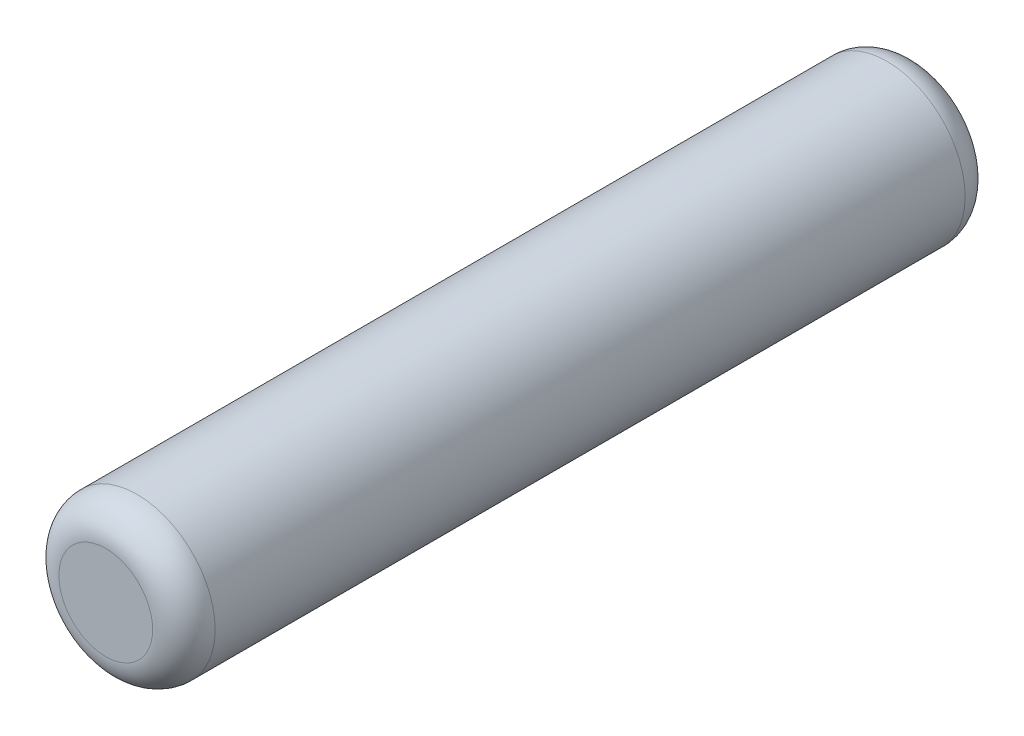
from build123d import *

# Parameters (mm, degrees)
SKETCH_1_R      = 1.25
EXTRUDE_1_DEPTH = 6.5
FILLET_1_R      = 0.5


with BuildPart() as part:
    # Sketch 1 → Extrude 1 (new, symmetric)
    with BuildSketch(Plane.XY):
        with Locations(Location((0, 0, 0), (0, 0, 180))):
            Circle(SKETCH_1_R)
    extrude(amount=EXTRUDE_1_DEPTH, both=True)

    # Fillet 1
    fillet_1_edges = [part.edges().sort_by_distance(p)[0] for p in [
        (1.25, 0, -6.5),
        (1.25, 0, 6.5),
    ]]
    fillet(fillet_1_edges, radius=FILLET_1_R)


solid = part.part
